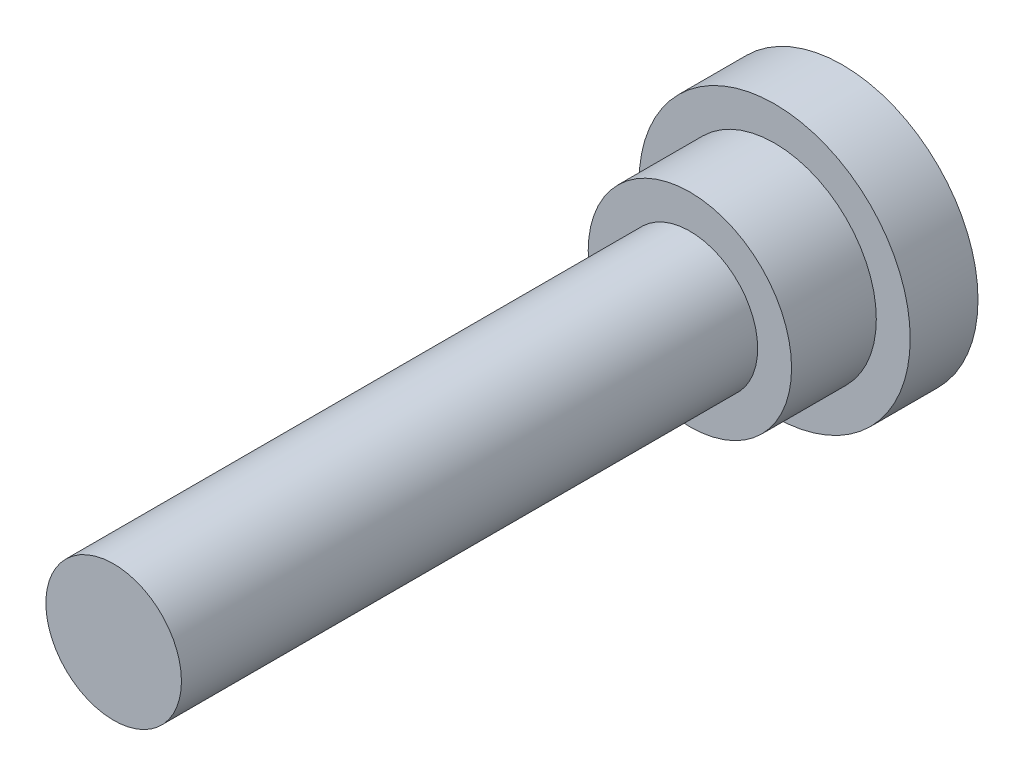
ISO-10303-21;
HEADER;
FILE_DESCRIPTION(('STEP AP214'),'2;1');
FILE_NAME('part.step','',(''),(''),'','','');
FILE_SCHEMA(('AUTOMOTIVE_DESIGN { 1 0 10303 214 1 1 1 1 }'));
ENDSEC;
DATA;
#1=APPLICATION_CONTEXT('core data for automotive mechanical design processes');
#2=APPLICATION_PROTOCOL_DEFINITION('international standard','automotive_design',2000,#1);
#3=PRODUCT_CONTEXT('',#1,'mechanical');
#4=PRODUCT('Part','Part','',(#3));
#5=PRODUCT_RELATED_PRODUCT_CATEGORY('part','',(#4));
#6=PRODUCT_DEFINITION_FORMATION('','',#4);
#7=PRODUCT_DEFINITION_CONTEXT('part definition',#1,'design');
#8=PRODUCT_DEFINITION('design','',#6,#7);
#9=PRODUCT_DEFINITION_SHAPE('','',#8);
#10=(LENGTH_UNIT() NAMED_UNIT(*) SI_UNIT(.MILLI.,.METRE.));
#11=(NAMED_UNIT(*) PLANE_ANGLE_UNIT() SI_UNIT($,.RADIAN.));
#12=(NAMED_UNIT(*) SI_UNIT($,.STERADIAN.) SOLID_ANGLE_UNIT());
#13=UNCERTAINTY_MEASURE_WITH_UNIT(LENGTH_MEASURE(1.E-05),#10,'distance_accuracy_value','');
#14=(GEOMETRIC_REPRESENTATION_CONTEXT(3) GLOBAL_UNCERTAINTY_ASSIGNED_CONTEXT((#13)) GLOBAL_UNIT_ASSIGNED_CONTEXT((#10,
#11,#12)) REPRESENTATION_CONTEXT('',''));
#15=CARTESIAN_POINT('',(0.,0.,0.));
#16=DIRECTION('',(0.,0.,1.));
#17=DIRECTION('',(1.,0.,0.));
#18=AXIS2_PLACEMENT_3D('',#15,#16,#17);
#19=CARTESIAN_POINT('',(0.,0.,43.));
#20=DIRECTION('',(0.,0.,1.));
#21=DIRECTION('',(1.,0.,0.));
#22=AXIS2_PLACEMENT_3D('',#19,#20,#21);
#23=PLANE('',#22);
#24=CARTESIAN_POINT('',(0.,0.,43.));
#25=DIRECTION('',(0.,0.,1.));
#26=DIRECTION('',(1.,0.,0.));
#27=AXIS2_PLACEMENT_3D('',#24,#25,#26);
#28=CIRCLE('',#27,4.);
#29=CARTESIAN_POINT('',(4.,0.,43.));
#30=VERTEX_POINT('',#29);
#31=EDGE_CURVE('E8',#30,#30,#28,.T.);
#32=ORIENTED_EDGE('',*,*,#31,.T.);
#33=EDGE_LOOP('',(#32));
#34=FACE_BOUND('',#33,.T.);
#35=ADVANCED_FACE('F12',(#34),#23,.T.);
#36=CARTESIAN_POINT('',(0.,0.,30.));
#37=DIRECTION('',(0.,0.,1.));
#38=DIRECTION('',(1.,0.,0.));
#39=AXIS2_PLACEMENT_3D('',#36,#37,#38);
#40=CYLINDRICAL_SURFACE('',#39,4.);
#41=CARTESIAN_POINT('',(0.,0.,9.));
#42=DIRECTION('',(0.,0.,1.));
#43=DIRECTION('',(1.,0.,0.));
#44=AXIS2_PLACEMENT_3D('',#41,#42,#43);
#45=CIRCLE('',#44,4.);
#46=CARTESIAN_POINT('',(4.,0.,9.));
#47=VERTEX_POINT('',#46);
#48=EDGE_CURVE('E18',#47,#47,#45,.T.);
#49=ORIENTED_EDGE('',*,*,#48,.T.);
#50=EDGE_LOOP('',(#49));
#51=FACE_BOUND('',#50,.T.);
#52=ORIENTED_EDGE('',*,*,#31,.F.);
#53=EDGE_LOOP('',(#52));
#54=FACE_BOUND('',#53,.T.);
#55=ADVANCED_FACE('F52',(#51,#54),#40,.T.);
#56=CARTESIAN_POINT('',(-4.,0.,9.));
#57=DIRECTION('',(0.,0.,1.));
#58=DIRECTION('',(1.,0.,0.));
#59=AXIS2_PLACEMENT_3D('',#56,#57,#58);
#60=PLANE('',#59);
#61=CARTESIAN_POINT('',(0.,0.,9.));
#62=DIRECTION('',(0.,0.,1.));
#63=DIRECTION('',(1.,0.,0.));
#64=AXIS2_PLACEMENT_3D('',#61,#62,#63);
#65=CIRCLE('',#64,6.);
#66=CARTESIAN_POINT('',(6.,0.,9.));
#67=VERTEX_POINT('',#66);
#68=EDGE_CURVE('E22',#67,#67,#65,.T.);
#69=ORIENTED_EDGE('',*,*,#68,.T.);
#70=EDGE_LOOP('',(#69));
#71=FACE_BOUND('',#70,.T.);
#72=ORIENTED_EDGE('',*,*,#48,.F.);
#73=EDGE_LOOP('',(#72));
#74=FACE_BOUND('',#73,.T.);
#75=ADVANCED_FACE('F57',(#71,#74),#60,.T.);
#76=CARTESIAN_POINT('',(0.,0.,30.));
#77=DIRECTION('',(0.,0.,1.));
#78=DIRECTION('',(1.,0.,0.));
#79=AXIS2_PLACEMENT_3D('',#76,#77,#78);
#80=CYLINDRICAL_SURFACE('',#79,6.);
#81=CARTESIAN_POINT('',(0.,0.,4.));
#82=DIRECTION('',(0.,0.,1.));
#83=DIRECTION('',(1.,0.,0.));
#84=AXIS2_PLACEMENT_3D('',#81,#82,#83);
#85=CIRCLE('',#84,6.);
#86=CARTESIAN_POINT('',(6.,0.,4.));
#87=VERTEX_POINT('',#86);
#88=EDGE_CURVE('E26',#87,#87,#85,.T.);
#89=ORIENTED_EDGE('',*,*,#88,.T.);
#90=EDGE_LOOP('',(#89));
#91=FACE_BOUND('',#90,.T.);
#92=ORIENTED_EDGE('',*,*,#68,.F.);
#93=EDGE_LOOP('',(#92));
#94=FACE_BOUND('',#93,.T.);
#95=ADVANCED_FACE('F62',(#91,#94),#80,.T.);
#96=CARTESIAN_POINT('',(-6.,0.,4.));
#97=DIRECTION('',(0.,0.,1.));
#98=DIRECTION('',(1.,0.,0.));
#99=AXIS2_PLACEMENT_3D('',#96,#97,#98);
#100=PLANE('',#99);
#101=CARTESIAN_POINT('',(0.,0.,4.));
#102=DIRECTION('',(0.,0.,1.));
#103=DIRECTION('',(1.,0.,0.));
#104=AXIS2_PLACEMENT_3D('',#101,#102,#103);
#105=CIRCLE('',#104,8.);
#106=CARTESIAN_POINT('',(8.,0.,4.));
#107=VERTEX_POINT('',#106);
#108=EDGE_CURVE('E31',#107,#107,#105,.T.);
#109=ORIENTED_EDGE('',*,*,#108,.T.);
#110=EDGE_LOOP('',(#109));
#111=FACE_BOUND('',#110,.T.);
#112=ORIENTED_EDGE('',*,*,#88,.F.);
#113=EDGE_LOOP('',(#112));
#114=FACE_BOUND('',#113,.T.);
#115=ADVANCED_FACE('F49',(#111,#114),#100,.T.);
#116=CARTESIAN_POINT('',(0.,0.,30.));
#117=DIRECTION('',(0.,0.,1.));
#118=DIRECTION('',(1.,0.,0.));
#119=AXIS2_PLACEMENT_3D('',#116,#117,#118);
#120=CYLINDRICAL_SURFACE('',#119,8.);
#121=CARTESIAN_POINT('',(0.,0.,0.));
#122=DIRECTION('',(0.,0.,1.));
#123=DIRECTION('',(1.,0.,0.));
#124=AXIS2_PLACEMENT_3D('',#121,#122,#123);
#125=CIRCLE('',#124,8.);
#126=CARTESIAN_POINT('',(8.,0.,0.));
#127=VERTEX_POINT('',#126);
#128=EDGE_CURVE('E34',#127,#127,#125,.T.);
#129=ORIENTED_EDGE('',*,*,#128,.T.);
#130=EDGE_LOOP('',(#129));
#131=FACE_BOUND('',#130,.T.);
#132=ORIENTED_EDGE('',*,*,#108,.F.);
#133=EDGE_LOOP('',(#132));
#134=FACE_BOUND('',#133,.T.);
#135=ADVANCED_FACE('F38',(#131,#134),#120,.T.);
#136=CARTESIAN_POINT('',(-8.,0.,0.));
#137=DIRECTION('',(0.,0.,-1.));
#138=DIRECTION('',(-1.,0.,0.));
#139=AXIS2_PLACEMENT_3D('',#136,#137,#138);
#140=PLANE('',#139);
#141=ORIENTED_EDGE('',*,*,#128,.F.);
#142=EDGE_LOOP('',(#141));
#143=FACE_BOUND('',#142,.T.);
#144=ADVANCED_FACE('F41',(#143),#140,.T.);
#145=CLOSED_SHELL('',(#35,#55,#75,#95,#115,#135,#144));
#146=MANIFOLD_SOLID_BREP('B1',#145);
#147=ADVANCED_BREP_SHAPE_REPRESENTATION('',(#18,#146),#14);
#148=SHAPE_DEFINITION_REPRESENTATION(#9,#147);
ENDSEC;
END-ISO-10303-21;
